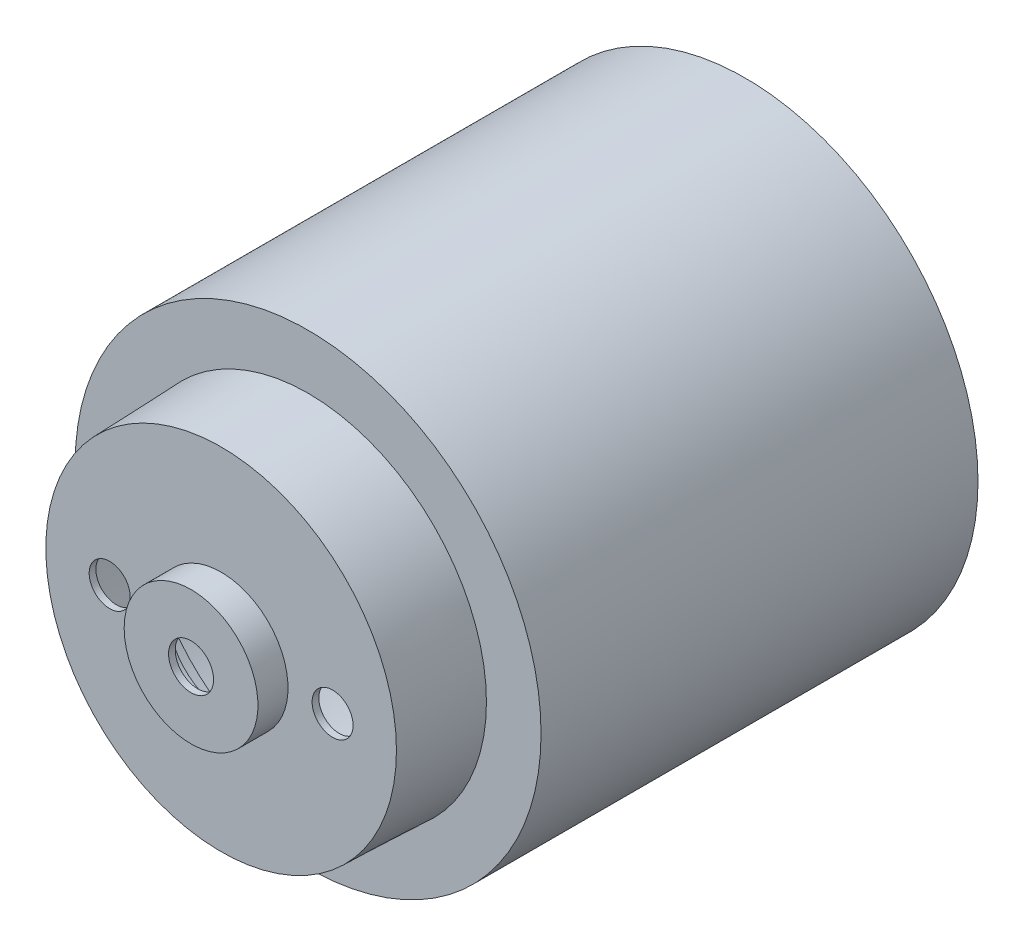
ISO-10303-21;
HEADER;
FILE_DESCRIPTION(('STEP AP214'),'2;1');
FILE_NAME('part.step','',(''),(''),'','','');
FILE_SCHEMA(('AUTOMOTIVE_DESIGN { 1 0 10303 214 1 1 1 1 }'));
ENDSEC;
DATA;
#1=APPLICATION_CONTEXT('core data for automotive mechanical design processes');
#2=APPLICATION_PROTOCOL_DEFINITION('international standard','automotive_design',2000,#1);
#3=PRODUCT_CONTEXT('',#1,'mechanical');
#4=PRODUCT('Part','Part','',(#3));
#5=PRODUCT_RELATED_PRODUCT_CATEGORY('part','',(#4));
#6=PRODUCT_DEFINITION_FORMATION('','',#4);
#7=PRODUCT_DEFINITION_CONTEXT('part definition',#1,'design');
#8=PRODUCT_DEFINITION('design','',#6,#7);
#9=PRODUCT_DEFINITION_SHAPE('','',#8);
#10=(LENGTH_UNIT() NAMED_UNIT(*) SI_UNIT(.MILLI.,.METRE.));
#11=(NAMED_UNIT(*) PLANE_ANGLE_UNIT() SI_UNIT($,.RADIAN.));
#12=(NAMED_UNIT(*) SI_UNIT($,.STERADIAN.) SOLID_ANGLE_UNIT());
#13=UNCERTAINTY_MEASURE_WITH_UNIT(LENGTH_MEASURE(1.E-05),#10,'distance_accuracy_value','');
#14=(GEOMETRIC_REPRESENTATION_CONTEXT(3) GLOBAL_UNCERTAINTY_ASSIGNED_CONTEXT((#13)) GLOBAL_UNIT_ASSIGNED_CONTEXT((#10,
#11,#12)) REPRESENTATION_CONTEXT('',''));
#15=CARTESIAN_POINT('',(0.,0.,0.));
#16=DIRECTION('',(0.,0.,1.));
#17=DIRECTION('',(1.,0.,0.));
#18=AXIS2_PLACEMENT_3D('',#15,#16,#17);
#19=CARTESIAN_POINT('',(0.,0.,23.5));
#20=DIRECTION('',(0.,0.,1.));
#21=DIRECTION('',(1.,0.,0.));
#22=AXIS2_PLACEMENT_3D('',#19,#20,#21);
#23=PLANE('',#22);
#24=CARTESIAN_POINT('',(5.,0.,23.5));
#25=DIRECTION('',(0.,0.,1.));
#26=DIRECTION('',(1.,0.,0.));
#27=AXIS2_PLACEMENT_3D('',#24,#25,#26);
#28=CIRCLE('',#27,0.92);
#29=CARTESIAN_POINT('',(5.92,0.,23.5));
#30=VERTEX_POINT('',#29);
#31=EDGE_CURVE('E56',#30,#30,#28,.T.);
#32=ORIENTED_EDGE('',*,*,#31,.F.);
#33=EDGE_LOOP('',(#32));
#34=FACE_BOUND('',#33,.T.);
#35=CARTESIAN_POINT('',(-5.,0.,23.5));
#36=DIRECTION('',(0.,0.,1.));
#37=DIRECTION('',(1.,0.,0.));
#38=AXIS2_PLACEMENT_3D('',#35,#36,#37);
#39=CIRCLE('',#38,0.92);
#40=CARTESIAN_POINT('',(-4.08,0.,23.5));
#41=VERTEX_POINT('',#40);
#42=EDGE_CURVE('E55',#41,#41,#39,.T.);
#43=ORIENTED_EDGE('',*,*,#42,.F.);
#44=EDGE_LOOP('',(#43));
#45=FACE_BOUND('',#44,.T.);
#46=CARTESIAN_POINT('',(0.,0.,23.5));
#47=DIRECTION('',(0.,0.,1.));
#48=DIRECTION('',(1.,0.,0.));
#49=AXIS2_PLACEMENT_3D('',#46,#47,#48);
#50=CIRCLE('',#49,7.86380899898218);
#51=CARTESIAN_POINT('',(7.86380899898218,0.,23.5));
#52=VERTEX_POINT('',#51);
#53=EDGE_CURVE('E42',#52,#52,#50,.T.);
#54=ORIENTED_EDGE('',*,*,#53,.T.);
#55=EDGE_LOOP('',(#54));
#56=FACE_BOUND('',#55,.T.);
#57=CARTESIAN_POINT('',(0.,0.,23.5));
#58=DIRECTION('',(0.,0.,1.));
#59=DIRECTION('',(1.,0.,0.));
#60=AXIS2_PLACEMENT_3D('',#57,#58,#59);
#61=CIRCLE('',#60,3.);
#62=CARTESIAN_POINT('',(-3.,0.,23.5));
#63=VERTEX_POINT('',#62);
#64=EDGE_CURVE('E82',#63,#63,#61,.T.);
#65=ORIENTED_EDGE('',*,*,#64,.F.);
#66=EDGE_LOOP('',(#65));
#67=FACE_BOUND('',#66,.T.);
#68=ADVANCED_FACE('F29',(#34,#45,#56,#67),#23,.T.);
#69=CARTESIAN_POINT('',(0.,0.,19.6));
#70=DIRECTION('',(0.,0.,1.));
#71=DIRECTION('',(1.,0.,0.));
#72=AXIS2_PLACEMENT_3D('',#69,#70,#71);
#73=PLANE('',#72);
#74=CARTESIAN_POINT('',(0.,0.,19.6));
#75=DIRECTION('',(0.,0.,1.));
#76=DIRECTION('',(1.,0.,0.));
#77=AXIS2_PLACEMENT_3D('',#74,#75,#76);
#78=CIRCLE('',#77,10.45);
#79=CARTESIAN_POINT('',(10.45,0.,19.6));
#80=VERTEX_POINT('',#79);
#81=EDGE_CURVE('E10',#80,#80,#78,.T.);
#82=ORIENTED_EDGE('',*,*,#81,.T.);
#83=EDGE_LOOP('',(#82));
#84=FACE_BOUND('',#83,.T.);
#85=CARTESIAN_POINT('',(0.,0.,19.6));
#86=DIRECTION('',(0.,0.,1.));
#87=DIRECTION('',(1.,0.,0.));
#88=AXIS2_PLACEMENT_3D('',#85,#86,#87);
#89=CIRCLE('',#88,8.);
#90=CARTESIAN_POINT('',(8.,0.,19.6));
#91=VERTEX_POINT('',#90);
#92=EDGE_CURVE('E48',#91,#91,#89,.T.);
#93=ORIENTED_EDGE('',*,*,#92,.F.);
#94=EDGE_LOOP('',(#93));
#95=FACE_BOUND('',#94,.T.);
#96=ADVANCED_FACE('F95',(#84,#95),#73,.T.);
#97=CARTESIAN_POINT('',(0.,0.,19.6));
#98=DIRECTION('',(0.,0.,-1.));
#99=DIRECTION('',(-1.,0.,0.));
#100=AXIS2_PLACEMENT_3D('',#97,#98,#99);
#101=CYLINDRICAL_SURFACE('',#100,10.45);
#102=ORIENTED_EDGE('',*,*,#81,.F.);
#103=EDGE_LOOP('',(#102));
#104=FACE_BOUND('',#103,.T.);
#105=CARTESIAN_POINT('',(0.,0.,0.));
#106=DIRECTION('',(0.,0.,1.));
#107=DIRECTION('',(1.,0.,0.));
#108=AXIS2_PLACEMENT_3D('',#105,#106,#107);
#109=CIRCLE('',#108,10.45);
#110=CARTESIAN_POINT('',(10.45,0.,0.));
#111=VERTEX_POINT('',#110);
#112=EDGE_CURVE('E37',#111,#111,#109,.T.);
#113=ORIENTED_EDGE('',*,*,#112,.T.);
#114=EDGE_LOOP('',(#113));
#115=FACE_BOUND('',#114,.T.);
#116=ADVANCED_FACE('F97',(#104,#115),#101,.T.);
#117=CARTESIAN_POINT('',(0.,0.,0.));
#118=DIRECTION('',(0.,0.,1.));
#119=DIRECTION('',(1.,0.,0.));
#120=AXIS2_PLACEMENT_3D('',#117,#118,#119);
#121=PLANE('',#120);
#122=CARTESIAN_POINT('',(0.,0.,0.));
#123=DIRECTION('',(0.,0.,1.));
#124=DIRECTION('',(1.,0.,0.));
#125=AXIS2_PLACEMENT_3D('',#122,#123,#124);
#126=CIRCLE('',#125,10.15);
#127=CARTESIAN_POINT('',(10.15,0.,0.));
#128=VERTEX_POINT('',#127);
#129=EDGE_CURVE('E72',#128,#128,#126,.T.);
#130=ORIENTED_EDGE('',*,*,#129,.T.);
#131=EDGE_LOOP('',(#130));
#132=FACE_BOUND('',#131,.T.);
#133=ORIENTED_EDGE('',*,*,#112,.F.);
#134=EDGE_LOOP('',(#133));
#135=FACE_BOUND('',#134,.T.);
#136=ADVANCED_FACE('F103',(#132,#135),#121,.F.);
#137=CARTESIAN_POINT('',(0.,0.,19.6));
#138=DIRECTION('',(0.,0.,-1.));
#139=DIRECTION('',(1.,0.,0.));
#140=AXIS2_PLACEMENT_3D('',#137,#138,#139);
#141=CONICAL_SURFACE('',#140,8.,0.0349065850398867);
#142=ORIENTED_EDGE('',*,*,#53,.F.);
#143=EDGE_LOOP('',(#142));
#144=FACE_BOUND('',#143,.T.);
#145=ORIENTED_EDGE('',*,*,#92,.T.);
#146=EDGE_LOOP('',(#145));
#147=FACE_BOUND('',#146,.T.);
#148=ADVANCED_FACE('F31',(#144,#147),#141,.T.);
#149=CARTESIAN_POINT('',(0.,0.,24.85));
#150=DIRECTION('',(0.,0.,-1.));
#151=DIRECTION('',(-1.,0.,0.));
#152=AXIS2_PLACEMENT_3D('',#149,#150,#151);
#153=CYLINDRICAL_SURFACE('',#152,3.);
#154=CARTESIAN_POINT('',(0.,0.,24.85));
#155=DIRECTION('',(0.,0.,1.));
#156=DIRECTION('',(1.,0.,0.));
#157=AXIS2_PLACEMENT_3D('',#154,#155,#156);
#158=CIRCLE('',#157,3.);
#159=CARTESIAN_POINT('',(-3.,0.,24.85));
#160=VERTEX_POINT('',#159);
#161=EDGE_CURVE('E89',#160,#160,#158,.T.);
#162=CARTESIAN_POINT('',(-3.,0.,24.85));
#163=CARTESIAN_POINT('',(-3.,0.,24.8359375));
#164=CARTESIAN_POINT('',(-3.,0.,24.821875));
#165=CARTESIAN_POINT('',(-3.,0.,24.79375));
#166=CARTESIAN_POINT('',(-3.,0.,24.7796875));
#167=CARTESIAN_POINT('',(-3.,0.,24.7515625));
#168=CARTESIAN_POINT('',(-3.,0.,24.7375));
#169=CARTESIAN_POINT('',(-3.,0.,24.709375));
#170=CARTESIAN_POINT('',(-3.,0.,24.6953125));
#171=CARTESIAN_POINT('',(-3.,0.,24.6671875));
#172=CARTESIAN_POINT('',(-3.,0.,24.653125));
#173=CARTESIAN_POINT('',(-3.,0.,24.625));
#174=CARTESIAN_POINT('',(-3.,0.,24.6109375));
#175=CARTESIAN_POINT('',(-3.,0.,24.5828125));
#176=CARTESIAN_POINT('',(-3.,0.,24.56875));
#177=CARTESIAN_POINT('',(-3.,0.,24.540625));
#178=CARTESIAN_POINT('',(-3.,0.,24.5265625));
#179=CARTESIAN_POINT('',(-3.,0.,24.4984375));
#180=CARTESIAN_POINT('',(-3.,0.,24.484375));
#181=CARTESIAN_POINT('',(-3.,0.,24.45625));
#182=CARTESIAN_POINT('',(-3.,0.,24.4421875));
#183=CARTESIAN_POINT('',(-3.,0.,24.4140625));
#184=CARTESIAN_POINT('',(-3.,0.,24.4));
#185=CARTESIAN_POINT('',(-3.,0.,24.371875));
#186=CARTESIAN_POINT('',(-3.,0.,24.3578125));
#187=CARTESIAN_POINT('',(-3.,0.,24.3296875));
#188=CARTESIAN_POINT('',(-3.,0.,24.315625));
#189=CARTESIAN_POINT('',(-3.,0.,24.2875));
#190=CARTESIAN_POINT('',(-3.,0.,24.2734375));
#191=CARTESIAN_POINT('',(-3.,0.,24.2453125));
#192=CARTESIAN_POINT('',(-3.,0.,24.23125));
#193=CARTESIAN_POINT('',(-3.,0.,24.203125));
#194=CARTESIAN_POINT('',(-3.,0.,24.1890625));
#195=CARTESIAN_POINT('',(-3.,0.,24.1609375));
#196=CARTESIAN_POINT('',(-3.,0.,24.146875));
#197=CARTESIAN_POINT('',(-3.,0.,24.11875));
#198=CARTESIAN_POINT('',(-3.,0.,24.1046875));
#199=CARTESIAN_POINT('',(-3.,0.,24.0765625));
#200=CARTESIAN_POINT('',(-3.,0.,24.0625));
#201=CARTESIAN_POINT('',(-3.,0.,24.034375));
#202=CARTESIAN_POINT('',(-3.,0.,24.0203125));
#203=CARTESIAN_POINT('',(-3.,0.,23.9921875));
#204=CARTESIAN_POINT('',(-3.,0.,23.978125));
#205=CARTESIAN_POINT('',(-3.,0.,23.95));
#206=CARTESIAN_POINT('',(-3.,0.,23.9359375));
#207=CARTESIAN_POINT('',(-3.,0.,23.9078125));
#208=CARTESIAN_POINT('',(-3.,0.,23.89375));
#209=CARTESIAN_POINT('',(-3.,0.,23.865625));
#210=CARTESIAN_POINT('',(-3.,0.,23.8515625));
#211=CARTESIAN_POINT('',(-3.,0.,23.8234375));
#212=CARTESIAN_POINT('',(-3.,0.,23.809375));
#213=CARTESIAN_POINT('',(-3.,0.,23.78125));
#214=CARTESIAN_POINT('',(-3.,0.,23.7671875));
#215=CARTESIAN_POINT('',(-3.,0.,23.7390625));
#216=CARTESIAN_POINT('',(-3.,0.,23.725));
#217=CARTESIAN_POINT('',(-3.,0.,23.696875));
#218=CARTESIAN_POINT('',(-3.,0.,23.6828125));
#219=CARTESIAN_POINT('',(-3.,0.,23.6546875));
#220=CARTESIAN_POINT('',(-3.,0.,23.640625));
#221=CARTESIAN_POINT('',(-3.,0.,23.6125));
#222=CARTESIAN_POINT('',(-3.,0.,23.5984375));
#223=CARTESIAN_POINT('',(-3.,0.,23.5703125));
#224=CARTESIAN_POINT('',(-3.,0.,23.55625));
#225=CARTESIAN_POINT('',(-3.,0.,23.528125));
#226=CARTESIAN_POINT('',(-3.,0.,23.5140625));
#227=CARTESIAN_POINT('',(-3.,0.,23.5));
#228=B_SPLINE_CURVE_WITH_KNOTS('',3,(#162,#163,#164,#165,#166,#167,#168,#169,#170,#171,#172,
#173,#174,#175,#176,#177,#178,#179,#180,#181,#182,#183,#184,#185,#186,#187,#188,#189,#190,#191,
#192,#193,#194,#195,#196,#197,#198,#199,#200,#201,#202,#203,#204,#205,#206,#207,#208,#209,#210,
#211,#212,#213,#214,#215,#216,#217,#218,#219,#220,#221,#222,#223,#224,#225,#226,#227),
.UNSPECIFIED.,.F.,.F.,(4,2,2,2,2,2,2,2,2,2,2,2,2,2,2,2,2,2,2,2,2,2,2,2,2,2,2,2,2,2,2,2,4),(0.,
0.0421875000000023,0.0843750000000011,0.126562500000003,0.168750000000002,0.210937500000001,
0.253125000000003,0.295312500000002,0.337500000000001,0.379687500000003,0.421875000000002,
0.464062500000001,0.506250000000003,0.548437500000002,0.590625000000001,0.632812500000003,
0.675000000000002,0.717187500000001,0.759375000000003,0.801562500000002,0.843750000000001,
0.885937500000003,0.928125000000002,0.970312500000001,1.0125,1.0546875,1.096875,1.1390625,
1.18125,1.2234375,1.265625,1.3078125,1.35),.UNSPECIFIED.);
#229=EDGE_CURVE('BSEAM112',#160,#63,#228,.T.);
#230=ORIENTED_EDGE('',*,*,#161,.F.);
#231=ORIENTED_EDGE('',*,*,#64,.T.);
#232=ORIENTED_EDGE('',*,*,#229,.T.);
#233=ORIENTED_EDGE('',*,*,#229,.F.);
#234=EDGE_LOOP('',(#230,#232,#231,#233));
#235=FACE_BOUND('',#234,.T.);
#236=ADVANCED_FACE('F112',(#235),#153,.T.);
#237=CARTESIAN_POINT('',(0.,0.,24.85));
#238=DIRECTION('',(0.,0.,1.));
#239=DIRECTION('',(1.,0.,0.));
#240=AXIS2_PLACEMENT_3D('',#237,#238,#239);
#241=PLANE('',#240);
#242=CARTESIAN_POINT('',(0.,0.,24.85));
#243=DIRECTION('',(0.,0.,1.));
#244=DIRECTION('',(1.,0.,0.));
#245=AXIS2_PLACEMENT_3D('',#242,#243,#244);
#246=CIRCLE('',#245,1.01);
#247=CARTESIAN_POINT('',(1.01,0.,24.85));
#248=VERTEX_POINT('',#247);
#249=EDGE_CURVE('E52',#248,#248,#246,.T.);
#250=ORIENTED_EDGE('',*,*,#249,.F.);
#251=EDGE_LOOP('',(#250));
#252=FACE_BOUND('',#251,.T.);
#253=ORIENTED_EDGE('',*,*,#161,.T.);
#254=EDGE_LOOP('',(#253));
#255=FACE_BOUND('',#254,.T.);
#256=ADVANCED_FACE('F114',(#252,#255),#241,.T.);
#257=CARTESIAN_POINT('',(0.,0.,23.2));
#258=DIRECTION('',(0.,0.,1.));
#259=DIRECTION('',(1.,0.,0.));
#260=AXIS2_PLACEMENT_3D('',#257,#258,#259);
#261=PLANE('',#260);
#262=CARTESIAN_POINT('',(5.,0.,23.2));
#263=DIRECTION('',(0.,0.,1.));
#264=DIRECTION('',(1.,0.,0.));
#265=AXIS2_PLACEMENT_3D('',#262,#263,#264);
#266=CIRCLE('',#265,0.92);
#267=CARTESIAN_POINT('',(5.92,0.,23.2));
#268=VERTEX_POINT('',#267);
#269=EDGE_CURVE('E33',#268,#268,#266,.T.);
#270=ORIENTED_EDGE('',*,*,#269,.T.);
#271=EDGE_LOOP('',(#270));
#272=FACE_BOUND('',#271,.T.);
#273=CARTESIAN_POINT('',(-5.,0.,23.2));
#274=DIRECTION('',(0.,0.,1.));
#275=DIRECTION('',(1.,0.,0.));
#276=AXIS2_PLACEMENT_3D('',#273,#274,#275);
#277=CIRCLE('',#276,0.92);
#278=CARTESIAN_POINT('',(-4.08,0.,23.2));
#279=VERTEX_POINT('',#278);
#280=EDGE_CURVE('E53',#279,#279,#277,.T.);
#281=ORIENTED_EDGE('',*,*,#280,.T.);
#282=EDGE_LOOP('',(#281));
#283=FACE_BOUND('',#282,.T.);
#284=CARTESIAN_POINT('',(0.,0.,23.2));
#285=DIRECTION('',(0.,0.,1.));
#286=DIRECTION('',(1.,0.,0.));
#287=AXIS2_PLACEMENT_3D('',#284,#285,#286);
#288=CIRCLE('',#287,7.57410236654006);
#289=CARTESIAN_POINT('',(7.57410236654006,0.,23.2));
#290=VERTEX_POINT('',#289);
#291=EDGE_CURVE('E69',#290,#290,#288,.T.);
#292=ORIENTED_EDGE('',*,*,#291,.F.);
#293=EDGE_LOOP('',(#292));
#294=FACE_BOUND('',#293,.T.);
#295=CARTESIAN_POINT('',(0.,0.,23.2));
#296=DIRECTION('',(0.,0.,1.));
#297=DIRECTION('',(1.,0.,0.));
#298=AXIS2_PLACEMENT_3D('',#295,#296,#297);
#299=CIRCLE('',#298,2.7);
#300=CARTESIAN_POINT('',(-2.7,0.,23.2));
#301=VERTEX_POINT('',#300);
#302=EDGE_CURVE('E51',#301,#301,#299,.T.);
#303=ORIENTED_EDGE('',*,*,#302,.T.);
#304=EDGE_LOOP('',(#303));
#305=FACE_BOUND('',#304,.T.);
#306=ADVANCED_FACE('F118',(#272,#283,#294,#305),#261,.F.);
#307=CARTESIAN_POINT('',(0.,0.,19.3));
#308=DIRECTION('',(0.,0.,1.));
#309=DIRECTION('',(1.,0.,0.));
#310=AXIS2_PLACEMENT_3D('',#307,#308,#309);
#311=PLANE('',#310);
#312=CARTESIAN_POINT('',(0.,0.,19.3));
#313=DIRECTION('',(0.,0.,1.));
#314=DIRECTION('',(1.,0.,0.));
#315=AXIS2_PLACEMENT_3D('',#312,#313,#314);
#316=CIRCLE('',#315,10.15);
#317=CARTESIAN_POINT('',(10.15,0.,19.3));
#318=VERTEX_POINT('',#317);
#319=EDGE_CURVE('E79',#318,#318,#316,.T.);
#320=ORIENTED_EDGE('',*,*,#319,.F.);
#321=EDGE_LOOP('',(#320));
#322=FACE_BOUND('',#321,.T.);
#323=CARTESIAN_POINT('',(0.,0.,19.3));
#324=DIRECTION('',(0.,0.,1.));
#325=DIRECTION('',(1.,0.,0.));
#326=AXIS2_PLACEMENT_3D('',#323,#324,#325);
#327=CIRCLE('',#326,7.71029336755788);
#328=CARTESIAN_POINT('',(7.71029336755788,0.,19.3));
#329=VERTEX_POINT('',#328);
#330=EDGE_CURVE('E73',#329,#329,#327,.T.);
#331=ORIENTED_EDGE('',*,*,#330,.T.);
#332=EDGE_LOOP('',(#331));
#333=FACE_BOUND('',#332,.T.);
#334=ADVANCED_FACE('F136',(#322,#333),#311,.F.);
#335=CARTESIAN_POINT('',(0.,0.,19.6));
#336=DIRECTION('',(0.,0.,-1.));
#337=DIRECTION('',(-1.,0.,0.));
#338=AXIS2_PLACEMENT_3D('',#335,#336,#337);
#339=CYLINDRICAL_SURFACE('',#338,10.15);
#340=ORIENTED_EDGE('',*,*,#319,.T.);
#341=EDGE_LOOP('',(#340));
#342=FACE_BOUND('',#341,.T.);
#343=ORIENTED_EDGE('',*,*,#129,.F.);
#344=EDGE_LOOP('',(#343));
#345=FACE_BOUND('',#344,.T.);
#346=ADVANCED_FACE('F132',(#342,#345),#339,.F.);
#347=CARTESIAN_POINT('',(0.,0.,19.5895301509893));
#348=DIRECTION('',(0.,0.,-1.));
#349=DIRECTION('',(1.,0.,0.));
#350=AXIS2_PLACEMENT_3D('',#347,#348,#349);
#351=CONICAL_SURFACE('',#350,7.70018275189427,0.0349065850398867);
#352=ORIENTED_EDGE('',*,*,#291,.T.);
#353=EDGE_LOOP('',(#352));
#354=FACE_BOUND('',#353,.T.);
#355=ORIENTED_EDGE('',*,*,#330,.F.);
#356=EDGE_LOOP('',(#355));
#357=FACE_BOUND('',#356,.T.);
#358=ADVANCED_FACE('F128',(#354,#357),#351,.F.);
#359=CARTESIAN_POINT('',(0.,0.,24.85));
#360=DIRECTION('',(0.,0.,-1.));
#361=DIRECTION('',(-1.,0.,0.));
#362=AXIS2_PLACEMENT_3D('',#359,#360,#361);
#363=CYLINDRICAL_SURFACE('',#362,2.7);
#364=CARTESIAN_POINT('',(0.,0.,24.55));
#365=DIRECTION('',(0.,0.,1.));
#366=DIRECTION('',(1.,0.,0.));
#367=AXIS2_PLACEMENT_3D('',#364,#365,#366);
#368=CIRCLE('',#367,2.7);
#369=CARTESIAN_POINT('',(-2.7,0.,24.55));
#370=VERTEX_POINT('',#369);
#371=EDGE_CURVE('E76',#370,#370,#368,.T.);
#372=CARTESIAN_POINT('',(-2.7,0.,24.55));
#373=CARTESIAN_POINT('',(-2.7,0.,24.5359375));
#374=CARTESIAN_POINT('',(-2.7,0.,24.521875));
#375=CARTESIAN_POINT('',(-2.7,0.,24.49375));
#376=CARTESIAN_POINT('',(-2.7,0.,24.4796875));
#377=CARTESIAN_POINT('',(-2.7,0.,24.4515625));
#378=CARTESIAN_POINT('',(-2.7,0.,24.4375));
#379=CARTESIAN_POINT('',(-2.7,0.,24.409375));
#380=CARTESIAN_POINT('',(-2.7,0.,24.3953125));
#381=CARTESIAN_POINT('',(-2.7,0.,24.3671875));
#382=CARTESIAN_POINT('',(-2.7,0.,24.353125));
#383=CARTESIAN_POINT('',(-2.7,0.,24.325));
#384=CARTESIAN_POINT('',(-2.7,0.,24.3109375));
#385=CARTESIAN_POINT('',(-2.7,0.,24.2828125));
#386=CARTESIAN_POINT('',(-2.7,0.,24.26875));
#387=CARTESIAN_POINT('',(-2.7,0.,24.240625));
#388=CARTESIAN_POINT('',(-2.7,0.,24.2265625));
#389=CARTESIAN_POINT('',(-2.7,0.,24.1984375));
#390=CARTESIAN_POINT('',(-2.7,0.,24.184375));
#391=CARTESIAN_POINT('',(-2.7,0.,24.15625));
#392=CARTESIAN_POINT('',(-2.7,0.,24.1421875));
#393=CARTESIAN_POINT('',(-2.7,0.,24.1140625));
#394=CARTESIAN_POINT('',(-2.7,0.,24.1));
#395=CARTESIAN_POINT('',(-2.7,0.,24.071875));
#396=CARTESIAN_POINT('',(-2.7,0.,24.0578125));
#397=CARTESIAN_POINT('',(-2.7,0.,24.0296875));
#398=CARTESIAN_POINT('',(-2.7,0.,24.015625));
#399=CARTESIAN_POINT('',(-2.7,0.,23.9875));
#400=CARTESIAN_POINT('',(-2.7,0.,23.9734375));
#401=CARTESIAN_POINT('',(-2.7,0.,23.9453125));
#402=CARTESIAN_POINT('',(-2.7,0.,23.93125));
#403=CARTESIAN_POINT('',(-2.7,0.,23.903125));
#404=CARTESIAN_POINT('',(-2.7,0.,23.8890625));
#405=CARTESIAN_POINT('',(-2.7,0.,23.8609375));
#406=CARTESIAN_POINT('',(-2.7,0.,23.846875));
#407=CARTESIAN_POINT('',(-2.7,0.,23.81875));
#408=CARTESIAN_POINT('',(-2.7,0.,23.8046875));
#409=CARTESIAN_POINT('',(-2.7,0.,23.7765625));
#410=CARTESIAN_POINT('',(-2.7,0.,23.7625));
#411=CARTESIAN_POINT('',(-2.7,0.,23.734375));
#412=CARTESIAN_POINT('',(-2.7,0.,23.7203125));
#413=CARTESIAN_POINT('',(-2.7,0.,23.6921875));
#414=CARTESIAN_POINT('',(-2.7,0.,23.678125));
#415=CARTESIAN_POINT('',(-2.7,0.,23.65));
#416=CARTESIAN_POINT('',(-2.7,0.,23.6359375));
#417=CARTESIAN_POINT('',(-2.7,0.,23.6078125));
#418=CARTESIAN_POINT('',(-2.7,0.,23.59375));
#419=CARTESIAN_POINT('',(-2.7,0.,23.565625));
#420=CARTESIAN_POINT('',(-2.7,0.,23.5515625));
#421=CARTESIAN_POINT('',(-2.7,0.,23.5234375));
#422=CARTESIAN_POINT('',(-2.7,0.,23.509375));
#423=CARTESIAN_POINT('',(-2.7,0.,23.48125));
#424=CARTESIAN_POINT('',(-2.7,0.,23.4671875));
#425=CARTESIAN_POINT('',(-2.7,0.,23.4390625));
#426=CARTESIAN_POINT('',(-2.7,0.,23.425));
#427=CARTESIAN_POINT('',(-2.7,0.,23.396875));
#428=CARTESIAN_POINT('',(-2.7,0.,23.3828125));
#429=CARTESIAN_POINT('',(-2.7,0.,23.3546875));
#430=CARTESIAN_POINT('',(-2.7,0.,23.340625));
#431=CARTESIAN_POINT('',(-2.7,0.,23.3125));
#432=CARTESIAN_POINT('',(-2.7,0.,23.2984375));
#433=CARTESIAN_POINT('',(-2.7,0.,23.2703125));
#434=CARTESIAN_POINT('',(-2.7,0.,23.25625));
#435=CARTESIAN_POINT('',(-2.7,0.,23.228125));
#436=CARTESIAN_POINT('',(-2.7,0.,23.2140625));
#437=CARTESIAN_POINT('',(-2.7,0.,23.2));
#438=B_SPLINE_CURVE_WITH_KNOTS('',3,(#372,#373,#374,#375,#376,#377,#378,#379,#380,#381,#382,
#383,#384,#385,#386,#387,#388,#389,#390,#391,#392,#393,#394,#395,#396,#397,#398,#399,#400,#401,
#402,#403,#404,#405,#406,#407,#408,#409,#410,#411,#412,#413,#414,#415,#416,#417,#418,#419,#420,
#421,#422,#423,#424,#425,#426,#427,#428,#429,#430,#431,#432,#433,#434,#435,#436,#437),
.UNSPECIFIED.,.F.,.F.,(4,2,2,2,2,2,2,2,2,2,2,2,2,2,2,2,2,2,2,2,2,2,2,2,2,2,2,2,2,2,2,2,4),(0.,
0.0421874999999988,0.0843749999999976,0.1265625,0.168749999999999,0.210937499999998,0.253125,
0.295312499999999,0.337499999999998,0.3796875,0.421874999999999,0.464062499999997,0.50625,
0.548437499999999,0.590624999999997,0.6328125,0.674999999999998,0.717187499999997,0.759375,
0.801562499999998,0.843749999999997,0.8859375,0.928124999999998,0.970312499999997,1.0125,
1.0546875,1.096875,1.1390625,1.18125,1.2234375,1.265625,1.3078125,1.35),.UNSPECIFIED.);
#439=EDGE_CURVE('BSEAM124',#370,#301,#438,.T.);
#440=ORIENTED_EDGE('',*,*,#371,.T.);
#441=ORIENTED_EDGE('',*,*,#302,.F.);
#442=ORIENTED_EDGE('',*,*,#439,.T.);
#443=ORIENTED_EDGE('',*,*,#439,.F.);
#444=EDGE_LOOP('',(#440,#442,#441,#443));
#445=FACE_BOUND('',#444,.T.);
#446=ADVANCED_FACE('F124',(#445),#363,.F.);
#447=CARTESIAN_POINT('',(0.,0.,24.55));
#448=DIRECTION('',(0.,0.,1.));
#449=DIRECTION('',(1.,0.,0.));
#450=AXIS2_PLACEMENT_3D('',#447,#448,#449);
#451=PLANE('',#450);
#452=CARTESIAN_POINT('',(0.,0.,24.55));
#453=DIRECTION('',(0.,0.,1.));
#454=DIRECTION('',(1.,0.,0.));
#455=AXIS2_PLACEMENT_3D('',#452,#453,#454);
#456=CIRCLE('',#455,1.01);
#457=CARTESIAN_POINT('',(1.01,0.,24.55));
#458=VERTEX_POINT('',#457);
#459=EDGE_CURVE('E49',#458,#458,#456,.T.);
#460=ORIENTED_EDGE('',*,*,#459,.T.);
#461=EDGE_LOOP('',(#460));
#462=FACE_BOUND('',#461,.T.);
#463=ORIENTED_EDGE('',*,*,#371,.F.);
#464=EDGE_LOOP('',(#463));
#465=FACE_BOUND('',#464,.T.);
#466=ADVANCED_FACE('F120',(#462,#465),#451,.F.);
#467=CARTESIAN_POINT('',(0.,0.,0.));
#468=DIRECTION('',(0.,0.,1.));
#469=DIRECTION('',(1.,0.,0.));
#470=AXIS2_PLACEMENT_3D('',#467,#468,#469);
#471=CYLINDRICAL_SURFACE('',#470,1.01);
#472=CARTESIAN_POINT('',(1.01,0.,24.85));
#473=CARTESIAN_POINT('',(1.01,0.,24.846875));
#474=CARTESIAN_POINT('',(1.01,0.,24.84375));
#475=CARTESIAN_POINT('',(1.01,0.,24.8375));
#476=CARTESIAN_POINT('',(1.01,0.,24.834375));
#477=CARTESIAN_POINT('',(1.01,0.,24.828125));
#478=CARTESIAN_POINT('',(1.01,0.,24.825));
#479=CARTESIAN_POINT('',(1.01,0.,24.81875));
#480=CARTESIAN_POINT('',(1.01,0.,24.815625));
#481=CARTESIAN_POINT('',(1.01,0.,24.809375));
#482=CARTESIAN_POINT('',(1.01,0.,24.80625));
#483=CARTESIAN_POINT('',(1.01,0.,24.8));
#484=CARTESIAN_POINT('',(1.01,0.,24.796875));
#485=CARTESIAN_POINT('',(1.01,0.,24.790625));
#486=CARTESIAN_POINT('',(1.01,0.,24.7875));
#487=CARTESIAN_POINT('',(1.01,0.,24.78125));
#488=CARTESIAN_POINT('',(1.01,0.,24.778125));
#489=CARTESIAN_POINT('',(1.01,0.,24.771875));
#490=CARTESIAN_POINT('',(1.01,0.,24.76875));
#491=CARTESIAN_POINT('',(1.01,0.,24.7625));
#492=CARTESIAN_POINT('',(1.01,0.,24.759375));
#493=CARTESIAN_POINT('',(1.01,0.,24.753125));
#494=CARTESIAN_POINT('',(1.01,0.,24.75));
#495=CARTESIAN_POINT('',(1.01,0.,24.74375));
#496=CARTESIAN_POINT('',(1.01,0.,24.740625));
#497=CARTESIAN_POINT('',(1.01,0.,24.734375));
#498=CARTESIAN_POINT('',(1.01,0.,24.73125));
#499=CARTESIAN_POINT('',(1.01,0.,24.725));
#500=CARTESIAN_POINT('',(1.01,0.,24.721875));
#501=CARTESIAN_POINT('',(1.01,0.,24.715625));
#502=CARTESIAN_POINT('',(1.01,0.,24.7125));
#503=CARTESIAN_POINT('',(1.01,0.,24.70625));
#504=CARTESIAN_POINT('',(1.01,0.,24.703125));
#505=CARTESIAN_POINT('',(1.01,0.,24.696875));
#506=CARTESIAN_POINT('',(1.01,0.,24.69375));
#507=CARTESIAN_POINT('',(1.01,0.,24.6875));
#508=CARTESIAN_POINT('',(1.01,0.,24.684375));
#509=CARTESIAN_POINT('',(1.01,0.,24.678125));
#510=CARTESIAN_POINT('',(1.01,0.,24.675));
#511=CARTESIAN_POINT('',(1.01,0.,24.66875));
#512=CARTESIAN_POINT('',(1.01,0.,24.665625));
#513=CARTESIAN_POINT('',(1.01,0.,24.659375));
#514=CARTESIAN_POINT('',(1.01,0.,24.65625));
#515=CARTESIAN_POINT('',(1.01,0.,24.65));
#516=CARTESIAN_POINT('',(1.01,0.,24.646875));
#517=CARTESIAN_POINT('',(1.01,0.,24.640625));
#518=CARTESIAN_POINT('',(1.01,0.,24.6375));
#519=CARTESIAN_POINT('',(1.01,0.,24.63125));
#520=CARTESIAN_POINT('',(1.01,0.,24.628125));
#521=CARTESIAN_POINT('',(1.01,0.,24.621875));
#522=CARTESIAN_POINT('',(1.01,0.,24.61875));
#523=CARTESIAN_POINT('',(1.01,0.,24.6125));
#524=CARTESIAN_POINT('',(1.01,0.,24.609375));
#525=CARTESIAN_POINT('',(1.01,0.,24.603125));
#526=CARTESIAN_POINT('',(1.01,0.,24.6));
#527=CARTESIAN_POINT('',(1.01,0.,24.59375));
#528=CARTESIAN_POINT('',(1.01,0.,24.590625));
#529=CARTESIAN_POINT('',(1.01,0.,24.584375));
#530=CARTESIAN_POINT('',(1.01,0.,24.58125));
#531=CARTESIAN_POINT('',(1.01,0.,24.575));
#532=CARTESIAN_POINT('',(1.01,0.,24.571875));
#533=CARTESIAN_POINT('',(1.01,0.,24.565625));
#534=CARTESIAN_POINT('',(1.01,0.,24.5625));
#535=CARTESIAN_POINT('',(1.01,0.,24.55625));
#536=CARTESIAN_POINT('',(1.01,0.,24.553125));
#537=CARTESIAN_POINT('',(1.01,0.,24.55));
#538=B_SPLINE_CURVE_WITH_KNOTS('',3,(#472,#473,#474,#475,#476,#477,#478,#479,#480,#481,#482,
#483,#484,#485,#486,#487,#488,#489,#490,#491,#492,#493,#494,#495,#496,#497,#498,#499,#500,#501,
#502,#503,#504,#505,#506,#507,#508,#509,#510,#511,#512,#513,#514,#515,#516,#517,#518,#519,#520,
#521,#522,#523,#524,#525,#526,#527,#528,#529,#530,#531,#532,#533,#534,#535,#536,#537),
.UNSPECIFIED.,.F.,.F.,(4,2,2,2,2,2,2,2,2,2,2,2,2,2,2,2,2,2,2,2,2,2,2,2,2,2,2,2,2,2,2,2,4),(0.,
0.00937499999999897,0.0187500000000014,0.0281250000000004,0.0374999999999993,0.0468750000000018,
0.0562500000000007,0.0656249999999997,0.0749999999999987,0.0843750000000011,0.0937500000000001,
0.103124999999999,0.112500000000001,0.121875,0.131249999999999,0.140625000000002,
0.150000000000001,0.159375,0.168750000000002,0.178125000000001,0.1875,0.196875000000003,
0.206250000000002,0.215625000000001,0.225000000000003,0.234375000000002,0.243750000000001,
0.253125,0.262500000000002,0.271875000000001,0.28125,0.290625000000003,0.300000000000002),.UNSPECIFIED.);
#539=EDGE_CURVE('BSEAM123',#248,#458,#538,.T.);
#540=ORIENTED_EDGE('',*,*,#249,.T.);
#541=ORIENTED_EDGE('',*,*,#459,.F.);
#542=ORIENTED_EDGE('',*,*,#539,.T.);
#543=ORIENTED_EDGE('',*,*,#539,.F.);
#544=EDGE_LOOP('',(#540,#542,#541,#543));
#545=FACE_BOUND('',#544,.T.);
#546=ADVANCED_FACE('F123',(#545),#471,.F.);
#547=CARTESIAN_POINT('',(-5.,0.,0.));
#548=DIRECTION('',(0.,0.,1.));
#549=DIRECTION('',(1.,0.,0.));
#550=AXIS2_PLACEMENT_3D('',#547,#548,#549);
#551=CYLINDRICAL_SURFACE('',#550,0.92);
#552=CARTESIAN_POINT('',(-4.08,0.,23.5));
#553=CARTESIAN_POINT('',(-4.08,0.,23.496875));
#554=CARTESIAN_POINT('',(-4.08,0.,23.49375));
#555=CARTESIAN_POINT('',(-4.08,0.,23.4875));
#556=CARTESIAN_POINT('',(-4.08,0.,23.484375));
#557=CARTESIAN_POINT('',(-4.08,0.,23.478125));
#558=CARTESIAN_POINT('',(-4.08,0.,23.475));
#559=CARTESIAN_POINT('',(-4.08,0.,23.46875));
#560=CARTESIAN_POINT('',(-4.08,0.,23.465625));
#561=CARTESIAN_POINT('',(-4.08,0.,23.459375));
#562=CARTESIAN_POINT('',(-4.08,0.,23.45625));
#563=CARTESIAN_POINT('',(-4.08,0.,23.45));
#564=CARTESIAN_POINT('',(-4.08,0.,23.446875));
#565=CARTESIAN_POINT('',(-4.08,0.,23.440625));
#566=CARTESIAN_POINT('',(-4.08,0.,23.4375));
#567=CARTESIAN_POINT('',(-4.08,0.,23.43125));
#568=CARTESIAN_POINT('',(-4.08,0.,23.428125));
#569=CARTESIAN_POINT('',(-4.08,0.,23.421875));
#570=CARTESIAN_POINT('',(-4.08,0.,23.41875));
#571=CARTESIAN_POINT('',(-4.08,0.,23.4125));
#572=CARTESIAN_POINT('',(-4.08,0.,23.409375));
#573=CARTESIAN_POINT('',(-4.08,0.,23.403125));
#574=CARTESIAN_POINT('',(-4.08,0.,23.4));
#575=CARTESIAN_POINT('',(-4.08,0.,23.39375));
#576=CARTESIAN_POINT('',(-4.08,0.,23.390625));
#577=CARTESIAN_POINT('',(-4.08,0.,23.384375));
#578=CARTESIAN_POINT('',(-4.08,0.,23.38125));
#579=CARTESIAN_POINT('',(-4.08,0.,23.375));
#580=CARTESIAN_POINT('',(-4.08,0.,23.371875));
#581=CARTESIAN_POINT('',(-4.08,0.,23.365625));
#582=CARTESIAN_POINT('',(-4.08,0.,23.3625));
#583=CARTESIAN_POINT('',(-4.08,0.,23.35625));
#584=CARTESIAN_POINT('',(-4.08,0.,23.353125));
#585=CARTESIAN_POINT('',(-4.08,0.,23.346875));
#586=CARTESIAN_POINT('',(-4.08,0.,23.34375));
#587=CARTESIAN_POINT('',(-4.08,0.,23.3375));
#588=CARTESIAN_POINT('',(-4.08,0.,23.334375));
#589=CARTESIAN_POINT('',(-4.08,0.,23.328125));
#590=CARTESIAN_POINT('',(-4.08,0.,23.325));
#591=CARTESIAN_POINT('',(-4.08,0.,23.31875));
#592=CARTESIAN_POINT('',(-4.08,0.,23.315625));
#593=CARTESIAN_POINT('',(-4.08,0.,23.309375));
#594=CARTESIAN_POINT('',(-4.08,0.,23.30625));
#595=CARTESIAN_POINT('',(-4.08,0.,23.3));
#596=CARTESIAN_POINT('',(-4.08,0.,23.296875));
#597=CARTESIAN_POINT('',(-4.08,0.,23.290625));
#598=CARTESIAN_POINT('',(-4.08,0.,23.2875));
#599=CARTESIAN_POINT('',(-4.08,0.,23.28125));
#600=CARTESIAN_POINT('',(-4.08,0.,23.278125));
#601=CARTESIAN_POINT('',(-4.08,0.,23.271875));
#602=CARTESIAN_POINT('',(-4.08,0.,23.26875));
#603=CARTESIAN_POINT('',(-4.08,0.,23.2625));
#604=CARTESIAN_POINT('',(-4.08,0.,23.259375));
#605=CARTESIAN_POINT('',(-4.08,0.,23.253125));
#606=CARTESIAN_POINT('',(-4.08,0.,23.25));
#607=CARTESIAN_POINT('',(-4.08,0.,23.24375));
#608=CARTESIAN_POINT('',(-4.08,0.,23.240625));
#609=CARTESIAN_POINT('',(-4.08,0.,23.234375));
#610=CARTESIAN_POINT('',(-4.08,0.,23.23125));
#611=CARTESIAN_POINT('',(-4.08,0.,23.225));
#612=CARTESIAN_POINT('',(-4.08,0.,23.221875));
#613=CARTESIAN_POINT('',(-4.08,0.,23.215625));
#614=CARTESIAN_POINT('',(-4.08,0.,23.2125));
#615=CARTESIAN_POINT('',(-4.08,0.,23.20625));
#616=CARTESIAN_POINT('',(-4.08,0.,23.203125));
#617=CARTESIAN_POINT('',(-4.08,0.,23.2));
#618=B_SPLINE_CURVE_WITH_KNOTS('',3,(#552,#553,#554,#555,#556,#557,#558,#559,#560,#561,#562,
#563,#564,#565,#566,#567,#568,#569,#570,#571,#572,#573,#574,#575,#576,#577,#578,#579,#580,#581,
#582,#583,#584,#585,#586,#587,#588,#589,#590,#591,#592,#593,#594,#595,#596,#597,#598,#599,#600,
#601,#602,#603,#604,#605,#606,#607,#608,#609,#610,#611,#612,#613,#614,#615,#616,#617),
.UNSPECIFIED.,.F.,.F.,(4,2,2,2,2,2,2,2,2,2,2,2,2,2,2,2,2,2,2,2,2,2,2,2,2,2,2,2,2,2,2,2,4),(0.,
0.00937499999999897,0.0187500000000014,0.0281250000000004,0.0374999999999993,0.0468750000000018,
0.0562500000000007,0.0656249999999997,0.0749999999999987,0.0843750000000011,0.0937500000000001,
0.103124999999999,0.112500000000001,0.121875,0.131249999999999,0.140625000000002,
0.150000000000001,0.159375,0.168750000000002,0.178125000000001,0.1875,0.196875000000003,
0.206250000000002,0.215625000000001,0.225000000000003,0.234375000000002,0.243750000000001,
0.253125,0.262500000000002,0.271875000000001,0.28125,0.290625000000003,0.300000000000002),.UNSPECIFIED.);
#619=EDGE_CURVE('BSEAM146',#41,#279,#618,.T.);
#620=ORIENTED_EDGE('',*,*,#42,.T.);
#621=ORIENTED_EDGE('',*,*,#280,.F.);
#622=ORIENTED_EDGE('',*,*,#619,.T.);
#623=ORIENTED_EDGE('',*,*,#619,.F.);
#624=EDGE_LOOP('',(#620,#622,#621,#623));
#625=FACE_BOUND('',#624,.T.);
#626=ADVANCED_FACE('F146',(#625),#551,.F.);
#627=CARTESIAN_POINT('',(5.,0.,0.));
#628=DIRECTION('',(0.,0.,1.));
#629=DIRECTION('',(1.,0.,0.));
#630=AXIS2_PLACEMENT_3D('',#627,#628,#629);
#631=CYLINDRICAL_SURFACE('',#630,0.92);
#632=CARTESIAN_POINT('',(5.92,0.,23.5));
#633=CARTESIAN_POINT('',(5.92,0.,23.496875));
#634=CARTESIAN_POINT('',(5.92,0.,23.49375));
#635=CARTESIAN_POINT('',(5.92,0.,23.4875));
#636=CARTESIAN_POINT('',(5.92,0.,23.484375));
#637=CARTESIAN_POINT('',(5.92,0.,23.478125));
#638=CARTESIAN_POINT('',(5.92,0.,23.475));
#639=CARTESIAN_POINT('',(5.92,0.,23.46875));
#640=CARTESIAN_POINT('',(5.92,0.,23.465625));
#641=CARTESIAN_POINT('',(5.92,0.,23.459375));
#642=CARTESIAN_POINT('',(5.92,0.,23.45625));
#643=CARTESIAN_POINT('',(5.92,0.,23.45));
#644=CARTESIAN_POINT('',(5.92,0.,23.446875));
#645=CARTESIAN_POINT('',(5.92,0.,23.440625));
#646=CARTESIAN_POINT('',(5.92,0.,23.4375));
#647=CARTESIAN_POINT('',(5.92,0.,23.43125));
#648=CARTESIAN_POINT('',(5.92,0.,23.428125));
#649=CARTESIAN_POINT('',(5.92,0.,23.421875));
#650=CARTESIAN_POINT('',(5.92,0.,23.41875));
#651=CARTESIAN_POINT('',(5.92,0.,23.4125));
#652=CARTESIAN_POINT('',(5.92,0.,23.409375));
#653=CARTESIAN_POINT('',(5.92,0.,23.403125));
#654=CARTESIAN_POINT('',(5.92,0.,23.4));
#655=CARTESIAN_POINT('',(5.92,0.,23.39375));
#656=CARTESIAN_POINT('',(5.92,0.,23.390625));
#657=CARTESIAN_POINT('',(5.92,0.,23.384375));
#658=CARTESIAN_POINT('',(5.92,0.,23.38125));
#659=CARTESIAN_POINT('',(5.92,0.,23.375));
#660=CARTESIAN_POINT('',(5.92,0.,23.371875));
#661=CARTESIAN_POINT('',(5.92,0.,23.365625));
#662=CARTESIAN_POINT('',(5.92,0.,23.3625));
#663=CARTESIAN_POINT('',(5.92,0.,23.35625));
#664=CARTESIAN_POINT('',(5.92,0.,23.353125));
#665=CARTESIAN_POINT('',(5.92,0.,23.346875));
#666=CARTESIAN_POINT('',(5.92,0.,23.34375));
#667=CARTESIAN_POINT('',(5.92,0.,23.3375));
#668=CARTESIAN_POINT('',(5.92,0.,23.334375));
#669=CARTESIAN_POINT('',(5.92,0.,23.328125));
#670=CARTESIAN_POINT('',(5.92,0.,23.325));
#671=CARTESIAN_POINT('',(5.92,0.,23.31875));
#672=CARTESIAN_POINT('',(5.92,0.,23.315625));
#673=CARTESIAN_POINT('',(5.92,0.,23.309375));
#674=CARTESIAN_POINT('',(5.92,0.,23.30625));
#675=CARTESIAN_POINT('',(5.92,0.,23.3));
#676=CARTESIAN_POINT('',(5.92,0.,23.296875));
#677=CARTESIAN_POINT('',(5.92,0.,23.290625));
#678=CARTESIAN_POINT('',(5.92,0.,23.2875));
#679=CARTESIAN_POINT('',(5.92,0.,23.28125));
#680=CARTESIAN_POINT('',(5.92,0.,23.278125));
#681=CARTESIAN_POINT('',(5.92,0.,23.271875));
#682=CARTESIAN_POINT('',(5.92,0.,23.26875));
#683=CARTESIAN_POINT('',(5.92,0.,23.2625));
#684=CARTESIAN_POINT('',(5.92,0.,23.259375));
#685=CARTESIAN_POINT('',(5.92,0.,23.253125));
#686=CARTESIAN_POINT('',(5.92,0.,23.25));
#687=CARTESIAN_POINT('',(5.92,0.,23.24375));
#688=CARTESIAN_POINT('',(5.92,0.,23.240625));
#689=CARTESIAN_POINT('',(5.92,0.,23.234375));
#690=CARTESIAN_POINT('',(5.92,0.,23.23125));
#691=CARTESIAN_POINT('',(5.92,0.,23.225));
#692=CARTESIAN_POINT('',(5.92,0.,23.221875));
#693=CARTESIAN_POINT('',(5.92,0.,23.215625));
#694=CARTESIAN_POINT('',(5.92,0.,23.2125));
#695=CARTESIAN_POINT('',(5.92,0.,23.20625));
#696=CARTESIAN_POINT('',(5.92,0.,23.203125));
#697=CARTESIAN_POINT('',(5.92,0.,23.2));
#698=B_SPLINE_CURVE_WITH_KNOTS('',3,(#632,#633,#634,#635,#636,#637,#638,#639,#640,#641,#642,
#643,#644,#645,#646,#647,#648,#649,#650,#651,#652,#653,#654,#655,#656,#657,#658,#659,#660,#661,
#662,#663,#664,#665,#666,#667,#668,#669,#670,#671,#672,#673,#674,#675,#676,#677,#678,#679,#680,
#681,#682,#683,#684,#685,#686,#687,#688,#689,#690,#691,#692,#693,#694,#695,#696,#697),
.UNSPECIFIED.,.F.,.F.,(4,2,2,2,2,2,2,2,2,2,2,2,2,2,2,2,2,2,2,2,2,2,2,2,2,2,2,2,2,2,2,2,4),(0.,
0.00937499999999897,0.0187500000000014,0.0281250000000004,0.0374999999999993,0.0468750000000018,
0.0562500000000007,0.0656249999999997,0.0749999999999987,0.0843750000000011,0.0937500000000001,
0.103124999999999,0.112500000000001,0.121875,0.131249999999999,0.140625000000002,
0.150000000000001,0.159375,0.168750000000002,0.178125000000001,0.1875,0.196875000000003,
0.206250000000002,0.215625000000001,0.225000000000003,0.234375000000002,0.243750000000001,
0.253125,0.262500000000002,0.271875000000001,0.28125,0.290625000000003,0.300000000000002),.UNSPECIFIED.);
#699=EDGE_CURVE('BSEAM150',#30,#268,#698,.T.);
#700=ORIENTED_EDGE('',*,*,#31,.T.);
#701=ORIENTED_EDGE('',*,*,#269,.F.);
#702=ORIENTED_EDGE('',*,*,#699,.T.);
#703=ORIENTED_EDGE('',*,*,#699,.F.);
#704=EDGE_LOOP('',(#700,#702,#701,#703));
#705=FACE_BOUND('',#704,.T.);
#706=ADVANCED_FACE('F150',(#705),#631,.F.);
#707=CLOSED_SHELL('',(#68,#96,#116,#136,#148,#236,#256,#306,#334,#346,#358,#446,#466,#546,#626,#706));
#708=MANIFOLD_SOLID_BREP('B2',#707);
#709=ADVANCED_BREP_SHAPE_REPRESENTATION('',(#18,#708),#14);
#710=SHAPE_DEFINITION_REPRESENTATION(#9,#709);
ENDSEC;
END-ISO-10303-21;
